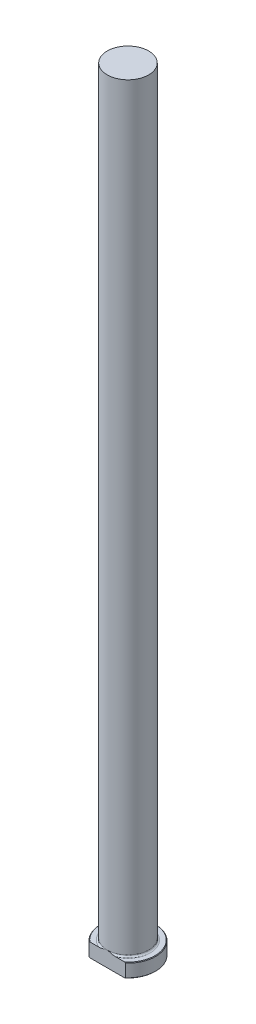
from build123d import *

# Parameters (mm, degrees)
CHAMFER1_SIZE = 0.254
FILLET1_R     = 0.762
KEY_DEPTH     = 357.053282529


with BuildPart() as part:
    # Sketch1 → Revolve1 (revolve)
    with BuildSketch(Plane.XY, mode=Mode.PRIVATE) as revolve1_sk:
        Polygon((0, 0), (-12.7, 0), (-12.7, 6.35), (-9.525, 6.35), (-9.525, 355.6), (0, 355.6), align=None)
    revolve(revolve1_sk.sketch.rotate(Axis((0, 259.958771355, 0), (0, -1, 0)), 270), axis=Axis((0, 259.958771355, 0), (0, -1, 0)))

    # Chamfer1
    chamfer1_edges = [part.edges().sort_by_distance(p)[0] for p in [
        (0, 6.35, -12.7),
        (0, 0, -12.7),
    ]]
    chamfer(chamfer1_edges, length=CHAMFER1_SIZE)

    # Fillet1
    fillet1_edges = [part.edges().sort_by_distance(p)[0] for p in [
        (0, 6.35, -9.525),
    ]]
    fillet(fillet1_edges, radius=FILLET1_R)

    # Sketch2 → KEY (cut, through all)
    with BuildSketch(Plane.XZ):
        with BuildLine():
            Line((-8.400260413, 9.525), (8.400260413, 9.525))
            ThreePointArc((8.400260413, 9.525), (0, 12.7), (-8.400260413, 9.525))
        make_face()
    extrude(amount=-KEY_DEPTH, mode=Mode.SUBTRACT)


solid = part.part
